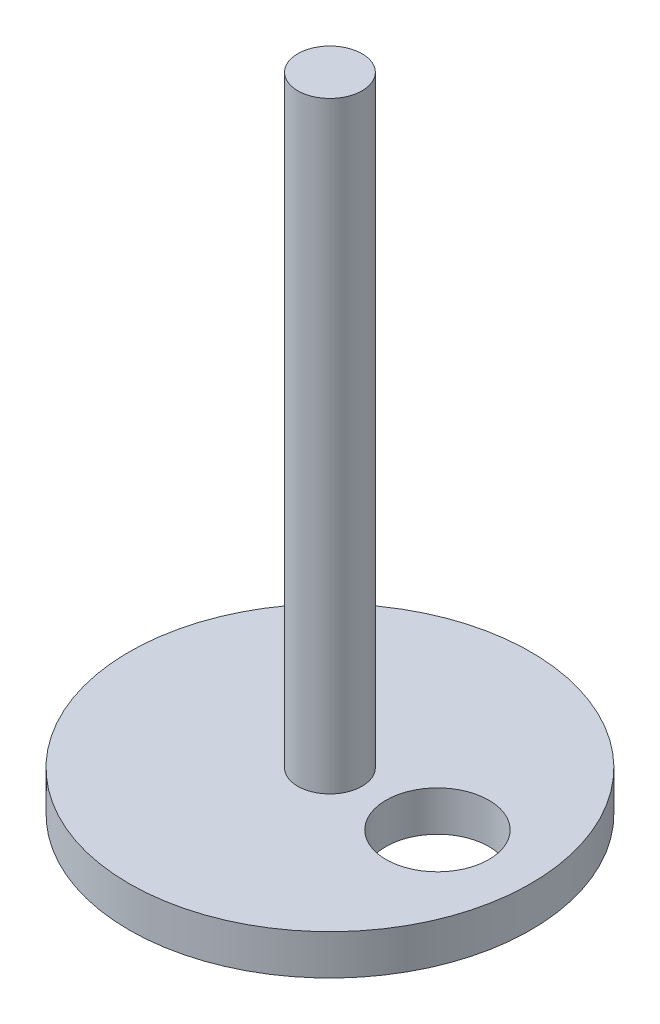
from build123d import *

# Parameters (mm, degrees)
SKETCH1_R           = 50
BOSS_EXTRUDE1_DEPTH = 10
SKETCH2_R           = 8
BOSS_EXTRUDE2_DEPTH = 150
SKETCH3_R           = 12.807098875
CUT_EXTRUDE1_DEPTH  = 10


with BuildPart() as part:
    # Sketch1 → Boss-Extrude1 (new body)
    with BuildSketch(Plane(origin=(0, 0, 0), x_dir=(1, 0, 0), z_dir=(0, 1, 0))):
        with Locations(Location((0, 0, 0), (0, 0, 270))):
            Circle(SKETCH1_R)
    extrude(amount=BOSS_EXTRUDE1_DEPTH)

    # Sketch2 → Boss-Extrude2 (add)
    with BuildSketch(Plane(origin=(0, 10, 0), x_dir=(1, 0, 0), z_dir=(0, 1, 0))):
        with Locations(Location((0, 0, 0), (0, 0, 270))):
            Circle(SKETCH2_R)
    extrude(amount=BOSS_EXTRUDE2_DEPTH)

    # Sketch3 → Cut-Extrude1 (cut)
    with BuildSketch(Plane.XZ):
        with Locations(Location((26.775331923, 0, 0), (0, 0, 270))):
            Circle(SKETCH3_R)
    extrude(amount=-CUT_EXTRUDE1_DEPTH, mode=Mode.SUBTRACT)


solid = part.part
